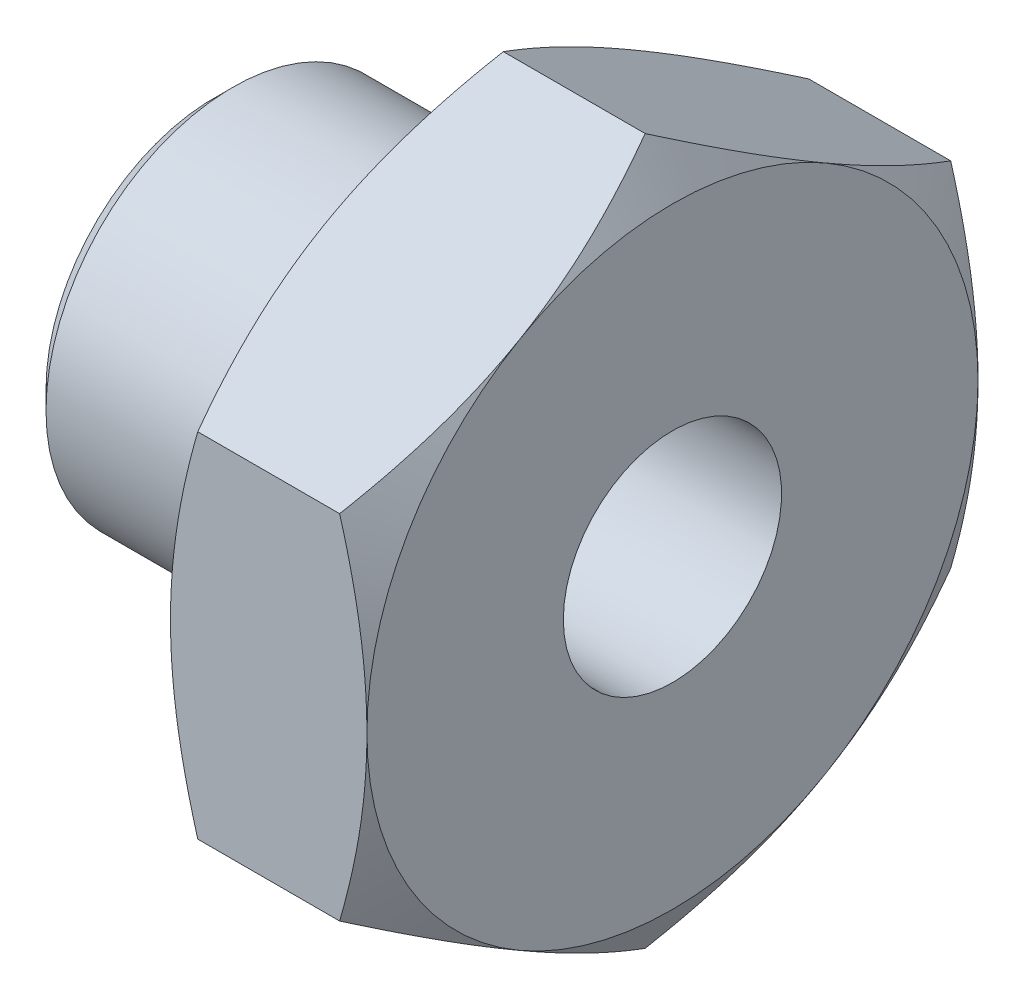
ISO-10303-21;
HEADER;
FILE_DESCRIPTION(('STEP AP214'),'2;1');
FILE_NAME('part.step','',(''),(''),'','','');
FILE_SCHEMA(('AUTOMOTIVE_DESIGN { 1 0 10303 214 1 1 1 1 }'));
ENDSEC;
DATA;
#1=APPLICATION_CONTEXT('core data for automotive mechanical design processes');
#2=APPLICATION_PROTOCOL_DEFINITION('international standard','automotive_design',2000,#1);
#3=PRODUCT_CONTEXT('',#1,'mechanical');
#4=PRODUCT('Part','Part','',(#3));
#5=PRODUCT_RELATED_PRODUCT_CATEGORY('part','',(#4));
#6=PRODUCT_DEFINITION_FORMATION('','',#4);
#7=PRODUCT_DEFINITION_CONTEXT('part definition',#1,'design');
#8=PRODUCT_DEFINITION('design','',#6,#7);
#9=PRODUCT_DEFINITION_SHAPE('','',#8);
#10=(LENGTH_UNIT() NAMED_UNIT(*) SI_UNIT(.MILLI.,.METRE.));
#11=(NAMED_UNIT(*) PLANE_ANGLE_UNIT() SI_UNIT($,.RADIAN.));
#12=(NAMED_UNIT(*) SI_UNIT($,.STERADIAN.) SOLID_ANGLE_UNIT());
#13=UNCERTAINTY_MEASURE_WITH_UNIT(LENGTH_MEASURE(1.E-05),#10,'distance_accuracy_value','');
#14=(GEOMETRIC_REPRESENTATION_CONTEXT(3) GLOBAL_UNCERTAINTY_ASSIGNED_CONTEXT((#13)) GLOBAL_UNIT_ASSIGNED_CONTEXT((#10,
#11,#12)) REPRESENTATION_CONTEXT('',''));
#15=CARTESIAN_POINT('',(0.,0.,0.));
#16=DIRECTION('',(0.,0.,1.));
#17=DIRECTION('',(1.,0.,0.));
#18=AXIS2_PLACEMENT_3D('',#15,#16,#17);
#19=CARTESIAN_POINT('',(-6.,0.,0.));
#20=DIRECTION('',(1.,0.,0.));
#21=DIRECTION('',(0.,0.,-1.));
#22=AXIS2_PLACEMENT_3D('',#19,#20,#21);
#23=PLANE('',#22);
#24=CARTESIAN_POINT('',(-6.,0.,0.));
#25=DIRECTION('',(-1.,0.,0.));
#26=DIRECTION('',(0.,0.,1.));
#27=AXIS2_PLACEMENT_3D('',#24,#25,#26);
#28=CIRCLE('',#27,3.852);
#29=CARTESIAN_POINT('',(-6.,0.,3.852));
#30=VERTEX_POINT('',#29);
#31=EDGE_CURVE('E144',#30,#30,#28,.T.);
#32=ORIENTED_EDGE('',*,*,#31,.T.);
#33=EDGE_LOOP('',(#32));
#34=FACE_BOUND('',#33,.T.);
#35=CARTESIAN_POINT('',(-6.,0.,0.));
#36=DIRECTION('',(-1.,0.,0.));
#37=DIRECTION('',(0.,0.,1.));
#38=AXIS2_PLACEMENT_3D('',#35,#36,#37);
#39=CIRCLE('',#38,2.5);
#40=CARTESIAN_POINT('',(-6.,0.,2.5));
#41=VERTEX_POINT('',#40);
#42=EDGE_CURVE('E519',#41,#41,#39,.T.);
#43=ORIENTED_EDGE('',*,*,#42,.F.);
#44=EDGE_LOOP('',(#43));
#45=FACE_BOUND('',#44,.T.);
#46=ADVANCED_FACE('F16',(#34,#45),#23,.F.);
#47=CARTESIAN_POINT('',(4.5,4.28,0.));
#48=DIRECTION('',(-1.,0.,0.));
#49=DIRECTION('',(0.,0.,1.));
#50=AXIS2_PLACEMENT_3D('',#47,#48,#49);
#51=PLANE('',#50);
#52=CARTESIAN_POINT('',(4.5,0.,0.));
#53=DIRECTION('',(-1.,0.,0.));
#54=DIRECTION('',(0.,0.,1.));
#55=AXIS2_PLACEMENT_3D('',#52,#53,#54);
#56=CIRCLE('',#55,7.);
#57=CARTESIAN_POINT('',(4.5,0.,7.));
#58=VERTEX_POINT('',#57);
#59=CARTESIAN_POINT('',(4.5,6.06217782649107,3.5));
#60=VERTEX_POINT('',#59);
#61=EDGE_CURVE('E266',#58,#60,#56,.T.);
#62=ORIENTED_EDGE('',*,*,#61,.F.);
#63=CARTESIAN_POINT('',(4.5,0.,0.));
#64=DIRECTION('',(-1.,0.,0.));
#65=DIRECTION('',(0.,0.,1.));
#66=AXIS2_PLACEMENT_3D('',#63,#64,#65);
#67=CIRCLE('',#66,7.);
#68=CARTESIAN_POINT('',(4.5,-6.06217782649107,3.5));
#69=VERTEX_POINT('',#68);
#70=EDGE_CURVE('E152',#69,#58,#67,.T.);
#71=ORIENTED_EDGE('',*,*,#70,.F.);
#72=CARTESIAN_POINT('',(4.5,-6.06217782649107,-3.5));
#73=VERTEX_POINT('',#72);
#74=EDGE_CURVE('E154',#73,#69,#67,.T.);
#75=ORIENTED_EDGE('',*,*,#74,.F.);
#76=CARTESIAN_POINT('',(4.5,0.,-7.));
#77=VERTEX_POINT('',#76);
#78=EDGE_CURVE('E160',#77,#73,#67,.T.);
#79=ORIENTED_EDGE('',*,*,#78,.F.);
#80=CARTESIAN_POINT('',(4.5,6.06217782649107,-3.5));
#81=VERTEX_POINT('',#80);
#82=EDGE_CURVE('E162',#81,#77,#67,.T.);
#83=ORIENTED_EDGE('',*,*,#82,.F.);
#84=EDGE_CURVE('E155',#60,#81,#67,.T.);
#85=ORIENTED_EDGE('',*,*,#84,.F.);
#86=EDGE_LOOP('',(#62,#71,#75,#79,#83,#85));
#87=FACE_BOUND('',#86,.T.);
#88=CARTESIAN_POINT('',(4.5,0.,0.));
#89=DIRECTION('',(-1.,0.,0.));
#90=DIRECTION('',(0.,0.,1.));
#91=AXIS2_PLACEMENT_3D('',#88,#89,#90);
#92=CIRCLE('',#91,2.5);
#93=CARTESIAN_POINT('',(4.5,0.,2.5));
#94=VERTEX_POINT('',#93);
#95=EDGE_CURVE('E335',#94,#94,#92,.T.);
#96=ORIENTED_EDGE('',*,*,#95,.T.);
#97=EDGE_LOOP('',(#96));
#98=FACE_BOUND('',#97,.T.);
#99=ADVANCED_FACE('F18',(#87,#98),#51,.F.);
#100=CARTESIAN_POINT('',(0.,-4.04145188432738,-7.));
#101=DIRECTION('',(1.,0.,0.));
#102=DIRECTION('',(0.,0.,-1.));
#103=AXIS2_PLACEMENT_3D('',#100,#101,#102);
#104=PLANE('',#103);
#105=CARTESIAN_POINT('',(0.,0.,0.));
#106=DIRECTION('',(1.,0.,0.));
#107=DIRECTION('',(0.,0.,-1.));
#108=AXIS2_PLACEMENT_3D('',#105,#106,#107);
#109=CIRCLE('',#108,4.28);
#110=CARTESIAN_POINT('',(0.,0.,-4.28));
#111=VERTEX_POINT('',#110);
#112=EDGE_CURVE('E150',#111,#111,#109,.T.);
#113=ORIENTED_EDGE('',*,*,#112,.T.);
#114=EDGE_LOOP('',(#113));
#115=FACE_BOUND('',#114,.T.);
#116=CARTESIAN_POINT('',(0.,0.,0.));
#117=DIRECTION('',(1.,0.,0.));
#118=DIRECTION('',(0.,0.,-1.));
#119=AXIS2_PLACEMENT_3D('',#116,#117,#118);
#120=CIRCLE('',#119,7.);
#121=CARTESIAN_POINT('',(0.,0.,-7.));
#122=VERTEX_POINT('',#121);
#123=CARTESIAN_POINT('',(0.,6.06217782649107,-3.5));
#124=VERTEX_POINT('',#123);
#125=EDGE_CURVE('E10',#122,#124,#120,.T.);
#126=ORIENTED_EDGE('',*,*,#125,.F.);
#127=CARTESIAN_POINT('',(0.,-6.06217782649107,-3.5));
#128=VERTEX_POINT('',#127);
#129=EDGE_CURVE('E20',#128,#122,#120,.T.);
#130=ORIENTED_EDGE('',*,*,#129,.F.);
#131=CARTESIAN_POINT('',(0.,-6.06217782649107,3.5));
#132=VERTEX_POINT('',#131);
#133=EDGE_CURVE('E167',#132,#128,#120,.T.);
#134=ORIENTED_EDGE('',*,*,#133,.F.);
#135=CARTESIAN_POINT('',(0.,0.,7.));
#136=VERTEX_POINT('',#135);
#137=EDGE_CURVE('E322',#136,#132,#120,.T.);
#138=ORIENTED_EDGE('',*,*,#137,.F.);
#139=CARTESIAN_POINT('',(0.,0.,0.));
#140=DIRECTION('',(-1.,0.,0.));
#141=DIRECTION('',(0.,0.,1.));
#142=AXIS2_PLACEMENT_3D('',#139,#140,#141);
#143=CIRCLE('',#142,7.);
#144=CARTESIAN_POINT('',(0.,6.06217782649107,3.5));
#145=VERTEX_POINT('',#144);
#146=EDGE_CURVE('E107',#136,#145,#143,.T.);
#147=ORIENTED_EDGE('',*,*,#146,.T.);
#148=EDGE_CURVE('E25',#124,#145,#120,.T.);
#149=ORIENTED_EDGE('',*,*,#148,.F.);
#150=EDGE_LOOP('',(#126,#130,#134,#138,#147,#149));
#151=FACE_BOUND('',#150,.T.);
#152=ADVANCED_FACE('F217',(#115,#151),#104,.F.);
#153=CARTESIAN_POINT('',(0.,0.,0.));
#154=DIRECTION('',(-1.,0.,0.));
#155=DIRECTION('',(0.,0.,1.));
#156=AXIS2_PLACEMENT_3D('',#153,#154,#155);
#157=CYLINDRICAL_SURFACE('',#156,4.28);
#158=CARTESIAN_POINT('',(-5.572,0.,0.));
#159=DIRECTION('',(-1.,0.,0.));
#160=DIRECTION('',(0.,0.,1.));
#161=AXIS2_PLACEMENT_3D('',#158,#159,#160);
#162=CIRCLE('',#161,4.28);
#163=CARTESIAN_POINT('',(-5.572,0.,4.28));
#164=VERTEX_POINT('',#163);
#165=EDGE_CURVE('E147',#164,#164,#162,.T.);
#166=ORIENTED_EDGE('',*,*,#165,.F.);
#167=EDGE_LOOP('',(#166));
#168=FACE_BOUND('',#167,.T.);
#169=ORIENTED_EDGE('',*,*,#112,.F.);
#170=EDGE_LOOP('',(#169));
#171=FACE_BOUND('',#170,.T.);
#172=ADVANCED_FACE('F310',(#168,#171),#157,.T.);
#173=CARTESIAN_POINT('',(-5.572,0.,0.));
#174=DIRECTION('',(1.,0.,0.));
#175=DIRECTION('',(0.,0.,-1.));
#176=AXIS2_PLACEMENT_3D('',#173,#174,#175);
#177=CONICAL_SURFACE('',#176,4.28,0.78539816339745);
#178=ORIENTED_EDGE('',*,*,#31,.F.);
#179=EDGE_LOOP('',(#178));
#180=FACE_BOUND('',#179,.T.);
#181=ORIENTED_EDGE('',*,*,#165,.T.);
#182=EDGE_LOOP('',(#181));
#183=FACE_BOUND('',#182,.T.);
#184=ADVANCED_FACE('F308',(#180,#183),#177,.T.);
#185=CARTESIAN_POINT('',(0.,0.,0.));
#186=DIRECTION('',(1.,0.,0.));
#187=DIRECTION('',(0.,0.,-1.));
#188=AXIS2_PLACEMENT_3D('',#185,#186,#187);
#189=CONICAL_SURFACE('',#188,7.,1.0471975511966);
#190=CARTESIAN_POINT('',(3.34968814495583,-10.7185284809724,-7.));
#191=CARTESIAN_POINT('',(3.20116463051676,-10.4111888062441,-7.));
#192=CARTESIAN_POINT('',(3.05411756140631,-10.1031224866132,-7.));
#193=CARTESIAN_POINT('',(2.76382000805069,-9.48514364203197,-7.));
#194=CARTESIAN_POINT('',(2.62057018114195,-9.17523080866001,-7.));
#195=CARTESIAN_POINT('',(2.33795615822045,-8.55149189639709,-7.));
#196=CARTESIAN_POINT('',(2.19861888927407,-8.2376535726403,-7.));
#197=CARTESIAN_POINT('',(1.92592921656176,-7.60739750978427,-7.));
#198=CARTESIAN_POINT('',(1.79257650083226,-7.29097990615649,-7.));
#199=CARTESIAN_POINT('',(1.53186418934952,-6.65113367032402,-7.));
#200=CARTESIAN_POINT('',(1.40459826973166,-6.32766665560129,-7.));
#201=CARTESIAN_POINT('',(1.16003377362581,-5.67691816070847,-7.));
#202=CARTESIAN_POINT('',(1.04273630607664,-5.34963626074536,-7.));
#203=CARTESIAN_POINT('',(0.821260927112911,-4.6914054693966,-7.));
#204=CARTESIAN_POINT('',(0.717055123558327,-4.36046606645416,-7.));
#205=CARTESIAN_POINT('',(0.525145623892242,-3.69389441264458,-7.));
#206=CARTESIAN_POINT('',(0.437436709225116,-3.35826368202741,-7.));
#207=CARTESIAN_POINT('',(0.282785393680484,-2.68202399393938,-7.));
#208=CARTESIAN_POINT('',(0.215848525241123,-2.34141373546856,-7.));
#209=CARTESIAN_POINT('',(0.134373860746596,-1.82750110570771,-7.));
#210=CARTESIAN_POINT('',(0.110368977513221,-1.65567627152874,-7.));
#211=CARTESIAN_POINT('',(0.0691417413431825,-1.31122101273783,-7.));
#212=CARTESIAN_POINT('',(0.0519187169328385,-1.13859066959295,-7.));
#213=CARTESIAN_POINT('',(0.0247186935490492,-0.793852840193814,-7.));
#214=CARTESIAN_POINT('',(0.014696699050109,-0.621748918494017,-7.));
#215=CARTESIAN_POINT('',(0.00195172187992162,-0.277271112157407,-7.));
#216=CARTESIAN_POINT('',(-0.00077135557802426,-0.104897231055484,-7.));
#217=CARTESIAN_POINT('',(0.0011463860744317,0.239761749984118,-7.));
#218=CARTESIAN_POINT('',(0.00578513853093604,0.412046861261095,-7.));
#219=CARTESIAN_POINT('',(0.02231118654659,0.756271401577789,-7.));
#220=CARTESIAN_POINT('',(0.0341988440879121,0.928210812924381,-7.));
#221=CARTESIAN_POINT('',(0.0715476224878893,1.34493894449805,-7.));
#222=CARTESIAN_POINT('',(0.100640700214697,1.58940748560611,-7.));
#223=CARTESIAN_POINT('',(0.171866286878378,2.07647122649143,-7.));
#224=CARTESIAN_POINT('',(0.214002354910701,2.31906589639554,-7.));
#225=CARTESIAN_POINT('',(0.309819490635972,2.80218175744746,-7.));
#226=CARTESIAN_POINT('',(0.363511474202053,3.04270076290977,-7.));
#227=CARTESIAN_POINT('',(0.480802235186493,3.52126417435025,-7.));
#228=CARTESIAN_POINT('',(0.544400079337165,3.75930881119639,-7.));
#229=CARTESIAN_POINT('',(0.681643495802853,4.23878647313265,-7.));
#230=CARTESIAN_POINT('',(0.755497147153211,4.48015952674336,-7.));
#231=CARTESIAN_POINT('',(0.910501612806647,4.96035431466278,-7.));
#232=CARTESIAN_POINT('',(0.991647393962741,5.19917768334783,-7.));
#233=CARTESIAN_POINT('',(1.15955997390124,5.67331479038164,-7.));
#234=CARTESIAN_POINT('',(1.2462925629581,5.90864071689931,-7.));
#235=CARTESIAN_POINT('',(1.42484844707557,6.37746676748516,-7.));
#236=CARTESIAN_POINT('',(1.51667379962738,6.61096610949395,-7.));
#237=CARTESIAN_POINT('',(1.61054174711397,6.84361717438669,-7.));
#238=B_SPLINE_CURVE_WITH_KNOTS('',3,(#190,#191,#192,#193,#194,#195,#196,#197,#198,#199,#200,
#201,#202,#203,#204,#205,#206,#207,#208,#209,#210,#211,#212,#213,#214,#215,#216,#217,#218,#219,
#220,#221,#222,#223,#224,#225,#226,#227,#228,#229,#230,#231,#232,#233,#234,#235,#236,#237),
.UNSPECIFIED.,.F.,.F.,(4,2,2,2,2,2,2,2,2,2,2,2,2,2,2,2,2,2,2,2,2,2,2,4),(0.,1.02405093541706,
2.04827800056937,3.07836630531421,4.10840085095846,5.15108102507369,6.19387704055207,
7.23441225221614,8.27461774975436,9.31510005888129,9.83546782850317,10.3557840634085,
10.8728201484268,11.3898495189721,11.906733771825,12.4236438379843,13.1618132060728,
13.900184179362,14.6392557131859,15.3782576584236,16.1353741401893,16.8919720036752,
17.6443112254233,18.3969566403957),.UNSPECIFIED.);
#239=CARTESIAN_POINT('',(0.62521478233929,-4.04145188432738,-7.));
#240=VERTEX_POINT('',#239);
#241=EDGE_CURVE('E123',#122,#240,#238,.F.);
#242=ORIENTED_EDGE('',*,*,#241,.T.);
#243=CARTESIAN_POINT('',(0.625281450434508,-4.04133641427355,-7.0002));
#244=CARTESIAN_POINT('',(0.573999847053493,-4.13017208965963,-6.84633209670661));
#245=CARTESIAN_POINT('',(0.525045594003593,-4.21933898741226,-6.69189049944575));
#246=CARTESIAN_POINT('',(0.43243278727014,-4.3983969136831,-6.38175307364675));
#247=CARTESIAN_POINT('',(0.388776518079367,-4.48828823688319,-6.22605673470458));
#248=CARTESIAN_POINT('',(0.266611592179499,-4.7594014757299,-5.75647483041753));
#249=CARTESIAN_POINT('',(0.197125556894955,-4.94169356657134,-5.4407356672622));
#250=CARTESIAN_POINT('',(0.115644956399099,-5.21449036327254,-4.96823775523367));
#251=CARTESIAN_POINT('',(0.092433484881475,-5.30417998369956,-4.81289077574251));
#252=CARTESIAN_POINT('',(0.0535112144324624,-5.48396448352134,-4.50149488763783));
#253=CARTESIAN_POINT('',(0.0377997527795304,-5.57405932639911,-4.34544604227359));
#254=CARTESIAN_POINT('',(0.0142779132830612,-5.75440548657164,-4.03307732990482));
#255=CARTESIAN_POINT('',(0.00645856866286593,-5.84465650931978,-3.87675797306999));
#256=CARTESIAN_POINT('',(-0.00111975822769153,-6.02523694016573,-3.56398349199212));
#257=CARTESIAN_POINT('',(-0.000878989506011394,-6.11556634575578,-3.40752837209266));
#258=CARTESIAN_POINT('',(0.0108597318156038,-6.36303901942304,-2.97889312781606));
#259=CARTESIAN_POINT('',(0.0305657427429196,-6.52010127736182,-2.7068533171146));
#260=CARTESIAN_POINT('',(0.0930534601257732,-6.83318259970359,-2.1645805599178));
#261=CARTESIAN_POINT('',(0.135856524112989,-6.98920056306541,-1.89434952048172));
#262=CARTESIAN_POINT('',(0.242851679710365,-7.30291195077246,-1.35098545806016));
#263=CARTESIAN_POINT('',(0.307497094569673,-7.46056579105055,-1.07792099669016));
#264=CARTESIAN_POINT('',(0.454216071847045,-7.77352241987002,-0.535864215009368));
#265=CARTESIAN_POINT('',(0.53625517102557,-7.92882921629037,-0.266864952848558));
#266=CARTESIAN_POINT('',(0.625281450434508,-8.0830192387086,0.000200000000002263));
#267=B_SPLINE_CURVE_WITH_KNOTS('',3,(#243,#244,#245,#246,#247,#248,#249,#250,#251,#252,#253,
#254,#255,#256,#257,#258,#259,#260,#261,#262,#263,#264,#265,#266),.UNSPECIFIED.,.F.,.F.,(4,2,2,
2,2,2,2,2,2,2,2,4),(0.,0.554727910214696,1.10969417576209,2.2219327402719,2.76443041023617,
3.30688013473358,3.8487128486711,4.3905288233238,5.33376515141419,6.27787517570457,
7.2429241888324,8.20607866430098),.UNSPECIFIED.);
#268=EDGE_CURVE('E112',#240,#128,#267,.T.);
#269=ORIENTED_EDGE('',*,*,#268,.T.);
#270=ORIENTED_EDGE('',*,*,#129,.T.);
#271=EDGE_LOOP('',(#242,#269,#270));
#272=FACE_BOUND('',#271,.T.);
#273=ADVANCED_FACE('F288',(#272),#189,.T.);
#274=CARTESIAN_POINT('',(0.62521478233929,-8.08290376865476,0.));
#275=VERTEX_POINT('',#274);
#276=EDGE_CURVE('E291',#128,#275,#267,.T.);
#277=ORIENTED_EDGE('',*,*,#276,.T.);
#278=CARTESIAN_POINT('',(0.625281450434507,-8.0830192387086,-0.00019999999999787));
#279=CARTESIAN_POINT('',(0.573999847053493,-7.99418356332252,0.153667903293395));
#280=CARTESIAN_POINT('',(0.525045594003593,-7.90501666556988,0.308109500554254));
#281=CARTESIAN_POINT('',(0.43243278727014,-7.72595873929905,0.618246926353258));
#282=CARTESIAN_POINT('',(0.388776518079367,-7.63606741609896,0.773943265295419));
#283=CARTESIAN_POINT('',(0.266611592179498,-7.36495417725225,1.24352516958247));
#284=CARTESIAN_POINT('',(0.197125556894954,-7.18266208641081,1.55926433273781));
#285=CARTESIAN_POINT('',(0.115644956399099,-6.9098652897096,2.03176224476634));
#286=CARTESIAN_POINT('',(0.0924334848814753,-6.82017566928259,2.18710922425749));
#287=CARTESIAN_POINT('',(0.0535112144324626,-6.64039116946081,2.49850511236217));
#288=CARTESIAN_POINT('',(0.03779975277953,-6.55029632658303,2.65455395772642));
#289=CARTESIAN_POINT('',(0.0142779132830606,-6.36995016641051,2.96692267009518));
#290=CARTESIAN_POINT('',(0.00645856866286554,-6.27969914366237,3.12324202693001));
#291=CARTESIAN_POINT('',(-0.00111975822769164,-6.09911871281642,3.43601650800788));
#292=CARTESIAN_POINT('',(-0.000878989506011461,-6.00878930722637,3.59247162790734));
#293=CARTESIAN_POINT('',(0.0108597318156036,-5.76131663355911,4.02110687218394));
#294=CARTESIAN_POINT('',(0.030565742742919,-5.60425437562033,4.2931466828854));
#295=CARTESIAN_POINT('',(0.0930534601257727,-5.29117305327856,4.8354194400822));
#296=CARTESIAN_POINT('',(0.135856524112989,-5.13515508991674,5.10565047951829));
#297=CARTESIAN_POINT('',(0.242851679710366,-4.82144370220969,5.64901454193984));
#298=CARTESIAN_POINT('',(0.307497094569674,-4.66378986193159,5.92207900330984));
#299=CARTESIAN_POINT('',(0.454216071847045,-4.35083323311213,6.46413578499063));
#300=CARTESIAN_POINT('',(0.536255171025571,-4.19552643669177,6.73313504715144));
#301=CARTESIAN_POINT('',(0.625281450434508,-4.04133641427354,7.0002));
#302=B_SPLINE_CURVE_WITH_KNOTS('',3,(#278,#279,#280,#281,#282,#283,#284,#285,#286,#287,#288,
#289,#290,#291,#292,#293,#294,#295,#296,#297,#298,#299,#300,#301),.UNSPECIFIED.,.F.,.F.,(4,2,2,
2,2,2,2,2,2,2,2,4),(0.,0.554727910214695,1.10969417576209,2.2219327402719,2.76443041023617,
3.30688013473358,3.8487128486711,4.39052882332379,5.33376515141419,6.27787517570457,
7.24292418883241,8.20607866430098),.UNSPECIFIED.);
#303=EDGE_CURVE('E329',#275,#132,#302,.T.);
#304=ORIENTED_EDGE('',*,*,#303,.T.);
#305=ORIENTED_EDGE('',*,*,#133,.T.);
#306=EDGE_LOOP('',(#277,#304,#305));
#307=FACE_BOUND('',#306,.T.);
#308=ADVANCED_FACE('F327',(#307),#189,.T.);
#309=CARTESIAN_POINT('',(3.34968693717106,-10.718525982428,7.));
#310=CARTESIAN_POINT('',(3.20116347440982,-10.4111863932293,7.));
#311=CARTESIAN_POINT('',(3.05411645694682,-10.1031201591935,7.));
#312=CARTESIAN_POINT('',(2.76381900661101,-9.48514148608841,7.));
#313=CARTESIAN_POINT('',(2.62056923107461,-9.1752287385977,7.));
#314=CARTESIAN_POINT('',(2.33795531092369,-8.55148999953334,7.));
#315=CARTESIAN_POINT('',(2.19861809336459,-8.23765176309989,7.));
#316=CARTESIAN_POINT('',(1.92592852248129,-7.60739587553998,7.));
#317=CARTESIAN_POINT('',(1.79257585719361,-7.29097835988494,7.));
#318=CARTESIAN_POINT('',(1.53186364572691,-6.65113230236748,7.));
#319=CARTESIAN_POINT('',(1.40459777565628,-6.32766537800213,7.));
#320=CARTESIAN_POINT('',(1.16003337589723,-5.67691706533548,7.));
#321=CARTESIAN_POINT('',(1.04273595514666,-5.34963525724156,7.));
#322=CARTESIAN_POINT('',(0.821260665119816,-4.6914046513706,7.));
#323=CARTESIAN_POINT('',(0.717054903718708,-4.36046534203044,7.));
#324=CARTESIAN_POINT('',(0.525145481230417,-3.69389387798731,7.));
#325=CARTESIAN_POINT('',(0.437436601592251,-3.35826324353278,7.));
#326=CARTESIAN_POINT('',(0.282785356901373,-2.68202380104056,7.));
#327=CARTESIAN_POINT('',(0.215848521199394,-2.34141369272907,7.));
#328=CARTESIAN_POINT('',(0.134373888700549,-1.82750129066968,7.));
#329=CARTESIAN_POINT('',(0.110369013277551,-1.65567653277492,7.));
#330=CARTESIAN_POINT('',(0.0691417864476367,-1.31122142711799,7.));
#331=CARTESIAN_POINT('',(0.0519187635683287,-1.13859116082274,7.));
#332=CARTESIAN_POINT('',(0.0247187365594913,-0.793853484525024,7.));
#333=CARTESIAN_POINT('',(0.0146967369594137,-0.621749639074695,7.));
#334=CARTESIAN_POINT('',(0.00195174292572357,-0.277271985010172,7.));
#335=CARTESIAN_POINT('',(-0.000771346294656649,-0.104898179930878,7.));
#336=CARTESIAN_POINT('',(0.00114636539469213,0.239760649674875,7.));
#337=CARTESIAN_POINT('',(0.00578509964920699,0.412045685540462,7.));
#338=CARTESIAN_POINT('',(0.022311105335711,0.756270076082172,7.));
#339=CARTESIAN_POINT('',(0.0341987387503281,0.928209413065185,7.));
#340=CARTESIAN_POINT('',(0.0715474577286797,1.34493742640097,7.));
#341=CARTESIAN_POINT('',(0.100640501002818,1.58940592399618,7.));
#342=CARTESIAN_POINT('',(0.171866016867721,2.07646957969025,7.));
#343=CARTESIAN_POINT('',(0.21400204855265,2.31906420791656,7.));
#344=CARTESIAN_POINT('',(0.309819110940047,2.80217998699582,7.));
#345=CARTESIAN_POINT('',(0.36351105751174,3.04269895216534,7.));
#346=CARTESIAN_POINT('',(0.480801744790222,3.5212622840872,7.));
#347=CARTESIAN_POINT('',(0.544399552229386,3.75930688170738,7.));
#348=CARTESIAN_POINT('',(0.681642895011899,4.23878446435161,7.));
#349=CARTESIAN_POINT('',(0.755496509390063,4.4801574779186,7.));
#350=CARTESIAN_POINT('',(0.910500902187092,4.9603521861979,7.));
#351=CARTESIAN_POINT('',(0.991646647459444,5.19917551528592,7.));
#352=CARTESIAN_POINT('',(1.15955915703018,5.67331254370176,7.));
#353=CARTESIAN_POINT('',(1.24629171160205,5.90863843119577,7.));
#354=CARTESIAN_POINT('',(1.42484752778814,6.37746440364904,7.));
#355=CARTESIAN_POINT('',(1.51667284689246,6.61096370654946,7.));
#356=CARTESIAN_POINT('',(1.61054076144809,6.84361473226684,7.));
#357=B_SPLINE_CURVE_WITH_KNOTS('',3,(#309,#310,#311,#312,#313,#314,#315,#316,#317,#318,#319,
#320,#321,#322,#323,#324,#325,#326,#327,#328,#329,#330,#331,#332,#333,#334,#335,#336,#337,#338,
#339,#340,#341,#342,#343,#344,#345,#346,#347,#348,#349,#350,#351,#352,#353,#354,#355,#356),
.UNSPECIFIED.,.F.,.F.,(4,2,2,2,2,2,2,2,2,2,2,2,2,2,2,2,2,2,2,2,2,2,2,4),(0.,1.02405063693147,
2.04827740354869,3.07836540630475,4.1083996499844,5.15107951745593,6.19387522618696,
7.23441013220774,8.27461532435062,9.31509717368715,9.83546471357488,10.35578071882,
10.8728165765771,11.3898457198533,11.9067297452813,12.4236395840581,13.1618088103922,
13.9001796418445,14.6392510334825,15.3782528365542,16.1353691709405,16.8919668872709,
17.6443059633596,18.3969512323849),.UNSPECIFIED.);
#358=CARTESIAN_POINT('',(0.62521478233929,-4.04145188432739,7.));
#359=VERTEX_POINT('',#358);
#360=EDGE_CURVE('E114',#359,#136,#357,.T.);
#361=ORIENTED_EDGE('',*,*,#360,.T.);
#362=ORIENTED_EDGE('',*,*,#137,.T.);
#363=EDGE_CURVE('E332',#132,#359,#302,.T.);
#364=ORIENTED_EDGE('',*,*,#363,.T.);
#365=EDGE_LOOP('',(#361,#362,#364));
#366=FACE_BOUND('',#365,.T.);
#367=ADVANCED_FACE('F418',(#366),#189,.T.);
#368=CARTESIAN_POINT('',(0.625281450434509,4.04133641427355,7.0002));
#369=CARTESIAN_POINT('',(0.573999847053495,4.13017208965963,6.84633209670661));
#370=CARTESIAN_POINT('',(0.525045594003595,4.21933898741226,6.69189049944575));
#371=CARTESIAN_POINT('',(0.432432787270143,4.3983969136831,6.38175307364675));
#372=CARTESIAN_POINT('',(0.388776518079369,4.48828823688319,6.22605673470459));
#373=CARTESIAN_POINT('',(0.266611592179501,4.7594014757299,5.75647483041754));
#374=CARTESIAN_POINT('',(0.197125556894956,4.94169356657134,5.4407356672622));
#375=CARTESIAN_POINT('',(0.1156449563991,5.21449036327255,4.96823775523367));
#376=CARTESIAN_POINT('',(0.0924334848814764,5.30417998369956,4.81289077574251));
#377=CARTESIAN_POINT('',(0.053511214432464,5.48396448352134,4.50149488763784));
#378=CARTESIAN_POINT('',(0.0377997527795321,5.57405932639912,4.34544604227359));
#379=CARTESIAN_POINT('',(0.014277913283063,5.75440548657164,4.03307732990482));
#380=CARTESIAN_POINT('',(0.00645856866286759,5.84465650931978,3.87675797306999));
#381=CARTESIAN_POINT('',(-0.00111975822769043,6.02523694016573,3.56398349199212));
#382=CARTESIAN_POINT('',(-0.000878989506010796,6.11556634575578,3.40752837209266));
#383=CARTESIAN_POINT('',(0.0108597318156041,6.36303901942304,2.97889312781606));
#384=CARTESIAN_POINT('',(0.030565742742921,6.52010127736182,2.7068533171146));
#385=CARTESIAN_POINT('',(0.0930534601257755,6.83318259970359,2.1645805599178));
#386=CARTESIAN_POINT('',(0.135856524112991,6.98920056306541,1.89434952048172));
#387=CARTESIAN_POINT('',(0.242851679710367,7.30291195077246,1.35098545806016));
#388=CARTESIAN_POINT('',(0.307497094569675,7.46056579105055,1.07792099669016));
#389=CARTESIAN_POINT('',(0.454216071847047,7.77352241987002,0.53586421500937));
#390=CARTESIAN_POINT('',(0.536255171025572,7.92882921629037,0.266864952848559));
#391=CARTESIAN_POINT('',(0.625281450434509,8.08301923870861,-0.000200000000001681));
#392=B_SPLINE_CURVE_WITH_KNOTS('',3,(#368,#369,#370,#371,#372,#373,#374,#375,#376,#377,#378,
#379,#380,#381,#382,#383,#384,#385,#386,#387,#388,#389,#390,#391),.UNSPECIFIED.,.F.,.F.,(4,2,2,
2,2,2,2,2,2,2,2,4),(0.,0.554727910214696,1.10969417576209,2.2219327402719,2.76443041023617,
3.30688013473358,3.8487128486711,4.3905288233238,5.33376515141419,6.27787517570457,
7.24292418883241,8.20607866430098),.UNSPECIFIED.);
#393=CARTESIAN_POINT('',(0.62521478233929,4.04145188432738,7.));
#394=VERTEX_POINT('',#393);
#395=EDGE_CURVE('E39',#394,#145,#392,.T.);
#396=ORIENTED_EDGE('',*,*,#395,.T.);
#397=ORIENTED_EDGE('',*,*,#146,.F.);
#398=EDGE_CURVE('E104',#136,#394,#357,.T.);
#399=ORIENTED_EDGE('',*,*,#398,.T.);
#400=EDGE_LOOP('',(#396,#397,#399));
#401=FACE_BOUND('',#400,.T.);
#402=ADVANCED_FACE('F105',(#401),#189,.T.);
#403=CARTESIAN_POINT('',(0.625281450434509,8.08301923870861,0.000199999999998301));
#404=CARTESIAN_POINT('',(0.573999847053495,7.99418356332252,-0.153667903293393));
#405=CARTESIAN_POINT('',(0.525045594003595,7.90501666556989,-0.308109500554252));
#406=CARTESIAN_POINT('',(0.432432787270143,7.72595873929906,-0.618246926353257));
#407=CARTESIAN_POINT('',(0.388776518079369,7.63606741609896,-0.773943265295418));
#408=CARTESIAN_POINT('',(0.2666115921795,7.36495417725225,-1.24352516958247));
#409=CARTESIAN_POINT('',(0.197125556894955,7.18266208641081,-1.5592643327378));
#410=CARTESIAN_POINT('',(0.1156449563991,6.90986528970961,-2.03176224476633));
#411=CARTESIAN_POINT('',(0.0924334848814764,6.82017566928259,-2.18710922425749));
#412=CARTESIAN_POINT('',(0.0535112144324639,6.64039116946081,-2.49850511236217));
#413=CARTESIAN_POINT('',(0.0377997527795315,6.55029632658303,-2.65455395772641));
#414=CARTESIAN_POINT('',(0.0142779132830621,6.36995016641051,-2.96692267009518));
#415=CARTESIAN_POINT('',(0.00645856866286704,6.27969914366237,-3.12324202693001));
#416=CARTESIAN_POINT('',(-0.00111975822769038,6.09911871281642,-3.43601650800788));
#417=CARTESIAN_POINT('',(-0.000878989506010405,6.00878930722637,-3.59247162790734));
#418=CARTESIAN_POINT('',(0.0108597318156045,5.76131663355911,-4.02110687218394));
#419=CARTESIAN_POINT('',(0.0305657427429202,5.60425437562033,-4.2931466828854));
#420=CARTESIAN_POINT('',(0.093053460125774,5.29117305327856,-4.8354194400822));
#421=CARTESIAN_POINT('',(0.13585652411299,5.13515508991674,-5.10565047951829));
#422=CARTESIAN_POINT('',(0.242851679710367,4.82144370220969,-5.64901454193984));
#423=CARTESIAN_POINT('',(0.307497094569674,4.6637898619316,-5.92207900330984));
#424=CARTESIAN_POINT('',(0.454216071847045,4.35083323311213,-6.46413578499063));
#425=CARTESIAN_POINT('',(0.53625517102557,4.19552643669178,-6.73313504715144));
#426=CARTESIAN_POINT('',(0.625281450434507,4.04133641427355,-7.0002));
#427=B_SPLINE_CURVE_WITH_KNOTS('',3,(#403,#404,#405,#406,#407,#408,#409,#410,#411,#412,#413,
#414,#415,#416,#417,#418,#419,#420,#421,#422,#423,#424,#425,#426),.UNSPECIFIED.,.F.,.F.,(4,2,2,
2,2,2,2,2,2,2,2,4),(0.,0.554727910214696,1.10969417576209,2.2219327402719,2.76443041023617,
3.30688013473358,3.84871284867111,4.3905288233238,5.33376515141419,6.27787517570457,
7.2429241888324,8.20607866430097),.UNSPECIFIED.);
#428=CARTESIAN_POINT('',(0.62521478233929,8.08290376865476,0.));
#429=VERTEX_POINT('',#428);
#430=EDGE_CURVE('E32',#429,#124,#427,.T.);
#431=ORIENTED_EDGE('',*,*,#430,.T.);
#432=ORIENTED_EDGE('',*,*,#148,.T.);
#433=EDGE_CURVE('E122',#145,#429,#392,.T.);
#434=ORIENTED_EDGE('',*,*,#433,.T.);
#435=EDGE_LOOP('',(#431,#432,#434));
#436=FACE_BOUND('',#435,.T.);
#437=ADVANCED_FACE('F214',(#436),#189,.T.);
#438=CARTESIAN_POINT('',(0.62521478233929,4.04145188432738,-7.));
#439=VERTEX_POINT('',#438);
#440=EDGE_CURVE('E258',#124,#439,#427,.T.);
#441=ORIENTED_EDGE('',*,*,#440,.T.);
#442=EDGE_CURVE('E281',#439,#122,#238,.F.);
#443=ORIENTED_EDGE('',*,*,#442,.T.);
#444=ORIENTED_EDGE('',*,*,#125,.T.);
#445=EDGE_LOOP('',(#441,#443,#444));
#446=FACE_BOUND('',#445,.T.);
#447=ADVANCED_FACE('F280',(#446),#189,.T.);
#448=CARTESIAN_POINT('',(3.87478521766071,0.,0.));
#449=DIRECTION('',(-1.,0.,0.));
#450=DIRECTION('',(0.,0.,1.));
#451=AXIS2_PLACEMENT_3D('',#448,#449,#450);
#452=CONICAL_SURFACE('',#451,8.08290376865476,1.0471975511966);
#453=CARTESIAN_POINT('',(3.8747185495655,-8.0830192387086,0.000200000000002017));
#454=CARTESIAN_POINT('',(3.92600015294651,-7.99418356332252,-0.153667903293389));
#455=CARTESIAN_POINT('',(3.97495440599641,-7.90501666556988,-0.308109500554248));
#456=CARTESIAN_POINT('',(4.06756721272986,-7.72595873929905,-0.618246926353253));
#457=CARTESIAN_POINT('',(4.11122348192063,-7.63606741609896,-0.773943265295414));
#458=CARTESIAN_POINT('',(4.2333884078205,-7.36495417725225,-1.24352516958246));
#459=CARTESIAN_POINT('',(4.30287444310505,-7.18266208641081,-1.5592643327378));
#460=CARTESIAN_POINT('',(4.3843550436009,-6.90986528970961,-2.03176224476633));
#461=CARTESIAN_POINT('',(4.40756651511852,-6.82017566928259,-2.18710922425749));
#462=CARTESIAN_POINT('',(4.44648878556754,-6.64039116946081,-2.49850511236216));
#463=CARTESIAN_POINT('',(4.46220024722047,-6.55029632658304,-2.65455395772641));
#464=CARTESIAN_POINT('',(4.48572208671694,-6.36995016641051,-2.96692267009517));
#465=CARTESIAN_POINT('',(4.49354143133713,-6.27969914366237,-3.12324202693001));
#466=CARTESIAN_POINT('',(4.50111975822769,-6.09911871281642,-3.43601650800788));
#467=CARTESIAN_POINT('',(4.50087898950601,-6.00878930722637,-3.59247162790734));
#468=CARTESIAN_POINT('',(4.4891402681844,-5.76131663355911,-4.02110687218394));
#469=CARTESIAN_POINT('',(4.46943425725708,-5.60425437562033,-4.2931466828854));
#470=CARTESIAN_POINT('',(4.40694653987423,-5.29117305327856,-4.8354194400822));
#471=CARTESIAN_POINT('',(4.36414347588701,-5.13515508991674,-5.10565047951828));
#472=CARTESIAN_POINT('',(4.25714832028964,-4.82144370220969,-5.64901454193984));
#473=CARTESIAN_POINT('',(4.19250290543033,-4.6637898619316,-5.92207900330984));
#474=CARTESIAN_POINT('',(4.04578392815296,-4.35083323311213,-6.46413578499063));
#475=CARTESIAN_POINT('',(3.96374482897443,-4.19552643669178,-6.73313504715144));
#476=CARTESIAN_POINT('',(3.8747185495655,-4.04133641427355,-7.0002));
#477=B_SPLINE_CURVE_WITH_KNOTS('',3,(#453,#454,#455,#456,#457,#458,#459,#460,#461,#462,#463,
#464,#465,#466,#467,#468,#469,#470,#471,#472,#473,#474,#475,#476),.UNSPECIFIED.,.F.,.F.,(4,2,2,
2,2,2,2,2,2,2,2,4),(0.,0.554727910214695,1.10969417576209,2.2219327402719,2.76443041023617,
3.30688013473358,3.8487128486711,4.39052882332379,5.33376515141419,6.27787517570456,
7.2429241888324,8.20607866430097),.UNSPECIFIED.);
#478=CARTESIAN_POINT('',(3.87478521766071,-4.04145188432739,-7.));
#479=VERTEX_POINT('',#478);
#480=EDGE_CURVE('E176',#73,#479,#477,.T.);
#481=ORIENTED_EDGE('',*,*,#480,.T.);
#482=CARTESIAN_POINT('',(1.15031185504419,-10.7185284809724,-7.));
#483=CARTESIAN_POINT('',(1.29883536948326,-10.4111888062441,-7.));
#484=CARTESIAN_POINT('',(1.44588243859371,-10.1031224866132,-7.));
#485=CARTESIAN_POINT('',(1.73617999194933,-9.48514364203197,-7.));
#486=CARTESIAN_POINT('',(1.87942981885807,-9.17523080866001,-7.));
#487=CARTESIAN_POINT('',(2.16204384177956,-8.55149189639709,-7.));
#488=CARTESIAN_POINT('',(2.30138111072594,-8.2376535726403,-7.));
#489=CARTESIAN_POINT('',(2.57407078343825,-7.60739750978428,-7.));
#490=CARTESIAN_POINT('',(2.70742349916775,-7.2909799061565,-7.));
#491=CARTESIAN_POINT('',(2.96813581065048,-6.65113367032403,-7.));
#492=CARTESIAN_POINT('',(3.09540173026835,-6.32766665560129,-7.));
#493=CARTESIAN_POINT('',(3.3399662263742,-5.67691816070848,-7.));
#494=CARTESIAN_POINT('',(3.45726369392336,-5.34963626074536,-7.));
#495=CARTESIAN_POINT('',(3.67873907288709,-4.6914054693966,-7.));
#496=CARTESIAN_POINT('',(3.78294487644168,-4.36046606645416,-7.));
#497=CARTESIAN_POINT('',(3.97485437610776,-3.69389441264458,-7.));
#498=CARTESIAN_POINT('',(4.06256329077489,-3.35826368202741,-7.));
#499=CARTESIAN_POINT('',(4.21721460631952,-2.68202399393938,-7.));
#500=CARTESIAN_POINT('',(4.28415147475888,-2.34141373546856,-7.));
#501=CARTESIAN_POINT('',(4.36562613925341,-1.82750110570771,-7.));
#502=CARTESIAN_POINT('',(4.38963102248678,-1.65567627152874,-7.));
#503=CARTESIAN_POINT('',(4.43085825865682,-1.31122101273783,-7.));
#504=CARTESIAN_POINT('',(4.44808128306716,-1.13859066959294,-7.));
#505=CARTESIAN_POINT('',(4.47528130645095,-0.793852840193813,-7.));
#506=CARTESIAN_POINT('',(4.48530330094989,-0.621748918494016,-7.));
#507=CARTESIAN_POINT('',(4.49804827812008,-0.277271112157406,-7.));
#508=CARTESIAN_POINT('',(4.50077135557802,-0.104897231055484,-7.));
#509=CARTESIAN_POINT('',(4.49885361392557,0.239761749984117,-7.));
#510=CARTESIAN_POINT('',(4.49421486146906,0.412046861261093,-7.));
#511=CARTESIAN_POINT('',(4.47768881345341,0.756271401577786,-7.));
#512=CARTESIAN_POINT('',(4.46580115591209,0.928210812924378,-7.));
#513=CARTESIAN_POINT('',(4.42845237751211,1.34493894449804,-7.));
#514=CARTESIAN_POINT('',(4.3993592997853,1.5894074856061,-7.));
#515=CARTESIAN_POINT('',(4.32813371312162,2.07647122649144,-7.));
#516=CARTESIAN_POINT('',(4.2859976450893,2.31906589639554,-7.));
#517=CARTESIAN_POINT('',(4.19018050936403,2.80218175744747,-7.));
#518=CARTESIAN_POINT('',(4.13648852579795,3.04270076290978,-7.));
#519=CARTESIAN_POINT('',(4.01919776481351,3.52126417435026,-7.));
#520=CARTESIAN_POINT('',(3.95559992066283,3.7593088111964,-7.));
#521=CARTESIAN_POINT('',(3.81835650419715,4.23878647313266,-7.));
#522=CARTESIAN_POINT('',(3.74450285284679,4.48015952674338,-7.));
#523=CARTESIAN_POINT('',(3.58949838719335,4.9603543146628,-7.));
#524=CARTESIAN_POINT('',(3.50835260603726,5.19917768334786,-7.));
#525=CARTESIAN_POINT('',(3.34044002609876,5.67331479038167,-7.));
#526=CARTESIAN_POINT('',(3.2537074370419,5.90864071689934,-7.));
#527=CARTESIAN_POINT('',(3.07515155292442,6.3774667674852,-7.));
#528=CARTESIAN_POINT('',(2.98332620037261,6.61096610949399,-7.));
#529=CARTESIAN_POINT('',(2.88945825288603,6.84361717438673,-7.));
#530=B_SPLINE_CURVE_WITH_KNOTS('',3,(#482,#483,#484,#485,#486,#487,#488,#489,#490,#491,#492,
#493,#494,#495,#496,#497,#498,#499,#500,#501,#502,#503,#504,#505,#506,#507,#508,#509,#510,#511,
#512,#513,#514,#515,#516,#517,#518,#519,#520,#521,#522,#523,#524,#525,#526,#527,#528,#529),
.UNSPECIFIED.,.F.,.F.,(4,2,2,2,2,2,2,2,2,2,2,2,2,2,2,2,2,2,2,2,2,2,2,4),(0.,1.02405093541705,
2.04827800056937,3.0783663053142,4.10840085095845,5.15108102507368,6.19387704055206,
7.23441225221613,8.27461774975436,9.31510005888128,9.83546782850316,10.3557840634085,
10.8728201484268,11.3898495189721,11.906733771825,12.4236438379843,13.1618132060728,
13.900184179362,14.6392557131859,15.3782576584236,16.1353741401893,16.8919720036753,
17.6443112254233,18.3969566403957),.UNSPECIFIED.);
#531=EDGE_CURVE('E178',#479,#77,#530,.T.);
#532=ORIENTED_EDGE('',*,*,#531,.T.);
#533=ORIENTED_EDGE('',*,*,#78,.T.);
#534=EDGE_LOOP('',(#481,#532,#533));
#535=FACE_BOUND('',#534,.T.);
#536=ADVANCED_FACE('F174',(#535),#452,.T.);
#537=CARTESIAN_POINT('',(3.87478521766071,4.04145188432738,-7.));
#538=VERTEX_POINT('',#537);
#539=EDGE_CURVE('E193',#77,#538,#530,.T.);
#540=ORIENTED_EDGE('',*,*,#539,.T.);
#541=CARTESIAN_POINT('',(3.8747185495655,4.04133641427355,-7.0002));
#542=CARTESIAN_POINT('',(3.92600015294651,4.13017208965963,-6.84633209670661));
#543=CARTESIAN_POINT('',(3.97495440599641,4.21933898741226,-6.69189049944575));
#544=CARTESIAN_POINT('',(4.06756721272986,4.3983969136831,-6.38175307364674));
#545=CARTESIAN_POINT('',(4.11122348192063,4.48828823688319,-6.22605673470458));
#546=CARTESIAN_POINT('',(4.2333884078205,4.7594014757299,-5.75647483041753));
#547=CARTESIAN_POINT('',(4.30287444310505,4.94169356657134,-5.4407356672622));
#548=CARTESIAN_POINT('',(4.3843550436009,5.21449036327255,-4.96823775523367));
#549=CARTESIAN_POINT('',(4.40756651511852,5.30417998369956,-4.81289077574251));
#550=CARTESIAN_POINT('',(4.44648878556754,5.48396448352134,-4.50149488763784));
#551=CARTESIAN_POINT('',(4.46220024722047,5.57405932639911,-4.34544604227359));
#552=CARTESIAN_POINT('',(4.48572208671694,5.75440548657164,-4.03307732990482));
#553=CARTESIAN_POINT('',(4.49354143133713,5.84465650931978,-3.87675797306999));
#554=CARTESIAN_POINT('',(4.50111975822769,6.02523694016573,-3.56398349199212));
#555=CARTESIAN_POINT('',(4.50087898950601,6.11556634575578,-3.40752837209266));
#556=CARTESIAN_POINT('',(4.48914026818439,6.36303901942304,-2.97889312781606));
#557=CARTESIAN_POINT('',(4.46943425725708,6.52010127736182,-2.7068533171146));
#558=CARTESIAN_POINT('',(4.40694653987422,6.83318259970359,-2.1645805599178));
#559=CARTESIAN_POINT('',(4.36414347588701,6.98920056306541,-1.89434952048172));
#560=CARTESIAN_POINT('',(4.25714832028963,7.30291195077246,-1.35098545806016));
#561=CARTESIAN_POINT('',(4.19250290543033,7.46056579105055,-1.07792099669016));
#562=CARTESIAN_POINT('',(4.04578392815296,7.77352241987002,-0.535864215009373));
#563=CARTESIAN_POINT('',(3.96374482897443,7.92882921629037,-0.266864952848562));
#564=CARTESIAN_POINT('',(3.87471854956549,8.08301923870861,0.000199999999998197));
#565=B_SPLINE_CURVE_WITH_KNOTS('',3,(#541,#542,#543,#544,#545,#546,#547,#548,#549,#550,#551,
#552,#553,#554,#555,#556,#557,#558,#559,#560,#561,#562,#563,#564),.UNSPECIFIED.,.F.,.F.,(4,2,2,
2,2,2,2,2,2,2,2,4),(0.,0.554727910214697,1.10969417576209,2.2219327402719,2.76443041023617,
3.30688013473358,3.8487128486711,4.39052882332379,5.33376515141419,6.27787517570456,
7.2429241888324,8.20607866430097),.UNSPECIFIED.);
#566=EDGE_CURVE('E247',#538,#81,#565,.T.);
#567=ORIENTED_EDGE('',*,*,#566,.T.);
#568=ORIENTED_EDGE('',*,*,#82,.T.);
#569=EDGE_LOOP('',(#540,#567,#568));
#570=FACE_BOUND('',#569,.T.);
#571=ADVANCED_FACE('F293',(#570),#452,.T.);
#572=CARTESIAN_POINT('',(3.87478521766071,8.08290376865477,0.));
#573=VERTEX_POINT('',#572);
#574=EDGE_CURVE('E242',#81,#573,#565,.T.);
#575=ORIENTED_EDGE('',*,*,#574,.T.);
#576=CARTESIAN_POINT('',(3.87471854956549,8.08301923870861,-0.000200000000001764));
#577=CARTESIAN_POINT('',(3.92600015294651,7.99418356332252,0.15366790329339));
#578=CARTESIAN_POINT('',(3.97495440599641,7.90501666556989,0.308109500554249));
#579=CARTESIAN_POINT('',(4.06756721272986,7.72595873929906,0.618246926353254));
#580=CARTESIAN_POINT('',(4.11122348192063,7.63606741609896,0.773943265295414));
#581=CARTESIAN_POINT('',(4.2333884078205,7.36495417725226,1.24352516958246));
#582=CARTESIAN_POINT('',(4.30287444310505,7.18266208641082,1.5592643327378));
#583=CARTESIAN_POINT('',(4.3843550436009,6.90986528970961,2.03176224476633));
#584=CARTESIAN_POINT('',(4.40756651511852,6.82017566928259,2.18710922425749));
#585=CARTESIAN_POINT('',(4.44648878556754,6.64039116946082,2.49850511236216));
#586=CARTESIAN_POINT('',(4.46220024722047,6.55029632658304,2.65455395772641));
#587=CARTESIAN_POINT('',(4.48572208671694,6.36995016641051,2.96692267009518));
#588=CARTESIAN_POINT('',(4.49354143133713,6.27969914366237,3.12324202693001));
#589=CARTESIAN_POINT('',(4.50111975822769,6.09911871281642,3.43601650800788));
#590=CARTESIAN_POINT('',(4.50087898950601,6.00878930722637,3.59247162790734));
#591=CARTESIAN_POINT('',(4.4891402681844,5.76131663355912,4.02110687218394));
#592=CARTESIAN_POINT('',(4.46943425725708,5.60425437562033,4.2931466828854));
#593=CARTESIAN_POINT('',(4.40694653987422,5.29117305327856,4.8354194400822));
#594=CARTESIAN_POINT('',(4.36414347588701,5.13515508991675,5.10565047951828));
#595=CARTESIAN_POINT('',(4.25714832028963,4.82144370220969,5.64901454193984));
#596=CARTESIAN_POINT('',(4.19250290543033,4.6637898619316,5.92207900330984));
#597=CARTESIAN_POINT('',(4.04578392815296,4.35083323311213,6.46413578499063));
#598=CARTESIAN_POINT('',(3.96374482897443,4.19552643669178,6.73313504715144));
#599=CARTESIAN_POINT('',(3.87471854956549,4.04133641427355,7.0002));
#600=B_SPLINE_CURVE_WITH_KNOTS('',3,(#576,#577,#578,#579,#580,#581,#582,#583,#584,#585,#586,
#587,#588,#589,#590,#591,#592,#593,#594,#595,#596,#597,#598,#599),.UNSPECIFIED.,.F.,.F.,(4,2,2,
2,2,2,2,2,2,2,2,4),(0.,0.554727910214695,1.10969417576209,2.2219327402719,2.76443041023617,
3.30688013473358,3.8487128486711,4.39052882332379,5.33376515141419,6.27787517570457,
7.2429241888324,8.20607866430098),.UNSPECIFIED.);
#601=EDGE_CURVE('E248',#573,#60,#600,.T.);
#602=ORIENTED_EDGE('',*,*,#601,.T.);
#603=ORIENTED_EDGE('',*,*,#84,.T.);
#604=EDGE_LOOP('',(#575,#602,#603));
#605=FACE_BOUND('',#604,.T.);
#606=ADVANCED_FACE('F272',(#605),#452,.T.);
#607=CARTESIAN_POINT('',(3.87478521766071,4.04145188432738,7.));
#608=VERTEX_POINT('',#607);
#609=EDGE_CURVE('E237',#60,#608,#600,.T.);
#610=ORIENTED_EDGE('',*,*,#609,.T.);
#611=CARTESIAN_POINT('',(1.15031306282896,-10.718525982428,7.));
#612=CARTESIAN_POINT('',(1.2988365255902,-10.4111863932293,7.));
#613=CARTESIAN_POINT('',(1.4458835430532,-10.1031201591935,7.));
#614=CARTESIAN_POINT('',(1.73618099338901,-9.48514148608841,7.));
#615=CARTESIAN_POINT('',(1.87943076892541,-9.1752287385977,7.));
#616=CARTESIAN_POINT('',(2.16204468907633,-8.55148999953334,7.));
#617=CARTESIAN_POINT('',(2.30138190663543,-8.23765176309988,7.));
#618=CARTESIAN_POINT('',(2.57407147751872,-7.60739587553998,7.));
#619=CARTESIAN_POINT('',(2.70742414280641,-7.29097835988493,7.));
#620=CARTESIAN_POINT('',(2.9681363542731,-6.65113230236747,7.));
#621=CARTESIAN_POINT('',(3.09540222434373,-6.32766537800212,7.));
#622=CARTESIAN_POINT('',(3.33996662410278,-5.67691706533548,7.));
#623=CARTESIAN_POINT('',(3.45726404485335,-5.34963525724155,7.));
#624=CARTESIAN_POINT('',(3.67873933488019,-4.6914046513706,7.));
#625=CARTESIAN_POINT('',(3.7829450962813,-4.36046534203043,7.));
#626=CARTESIAN_POINT('',(3.97485451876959,-3.69389387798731,7.));
#627=CARTESIAN_POINT('',(4.06256339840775,-3.35826324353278,7.));
#628=CARTESIAN_POINT('',(4.21721464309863,-2.68202380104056,7.));
#629=CARTESIAN_POINT('',(4.28415147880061,-2.34141369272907,7.));
#630=CARTESIAN_POINT('',(4.36562611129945,-1.82750129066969,7.));
#631=CARTESIAN_POINT('',(4.38963098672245,-1.65567653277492,7.));
#632=CARTESIAN_POINT('',(4.43085821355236,-1.31122142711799,7.));
#633=CARTESIAN_POINT('',(4.44808123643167,-1.13859116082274,7.));
#634=CARTESIAN_POINT('',(4.47528126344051,-0.793853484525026,7.));
#635=CARTESIAN_POINT('',(4.48530326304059,-0.621749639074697,7.));
#636=CARTESIAN_POINT('',(4.49804825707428,-0.277271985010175,7.));
#637=CARTESIAN_POINT('',(4.50077134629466,-0.104898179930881,7.));
#638=CARTESIAN_POINT('',(4.49885363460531,0.239760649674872,7.));
#639=CARTESIAN_POINT('',(4.49421490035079,0.412045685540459,7.));
#640=CARTESIAN_POINT('',(4.47768889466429,0.756270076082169,7.));
#641=CARTESIAN_POINT('',(4.46580126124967,0.92820941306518,7.));
#642=CARTESIAN_POINT('',(4.42845254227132,1.34493742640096,7.));
#643=CARTESIAN_POINT('',(4.39935949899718,1.58940592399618,7.));
#644=CARTESIAN_POINT('',(4.32813398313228,2.07646957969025,7.));
#645=CARTESIAN_POINT('',(4.28599795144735,2.31906420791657,7.));
#646=CARTESIAN_POINT('',(4.19018088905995,2.80217998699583,7.));
#647=CARTESIAN_POINT('',(4.13648894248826,3.04269895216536,7.));
#648=CARTESIAN_POINT('',(4.01919825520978,3.52126228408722,7.));
#649=CARTESIAN_POINT('',(3.95560044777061,3.7593068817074,7.));
#650=CARTESIAN_POINT('',(3.8183571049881,4.23878446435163,7.));
#651=CARTESIAN_POINT('',(3.74450349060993,4.48015747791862,7.));
#652=CARTESIAN_POINT('',(3.5894990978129,4.96035218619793,7.));
#653=CARTESIAN_POINT('',(3.50835335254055,5.19917551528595,7.));
#654=CARTESIAN_POINT('',(3.34044084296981,5.67331254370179,7.));
#655=CARTESIAN_POINT('',(3.25370828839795,5.90863843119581,7.));
#656=CARTESIAN_POINT('',(3.07515247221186,6.37746440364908,7.));
#657=CARTESIAN_POINT('',(2.98332715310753,6.61096370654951,7.));
#658=CARTESIAN_POINT('',(2.8894592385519,6.84361473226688,7.));
#659=B_SPLINE_CURVE_WITH_KNOTS('',3,(#611,#612,#613,#614,#615,#616,#617,#618,#619,#620,#621,
#622,#623,#624,#625,#626,#627,#628,#629,#630,#631,#632,#633,#634,#635,#636,#637,#638,#639,#640,
#641,#642,#643,#644,#645,#646,#647,#648,#649,#650,#651,#652,#653,#654,#655,#656,#657,#658),
.UNSPECIFIED.,.F.,.F.,(4,2,2,2,2,2,2,2,2,2,2,2,2,2,2,2,2,2,2,2,2,2,2,4),(0.,1.02405063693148,
2.04827740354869,3.07836540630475,4.10839964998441,5.15107951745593,6.19387522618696,
7.23441013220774,8.27461532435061,9.31509717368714,9.83546471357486,10.3557807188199,
10.8728165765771,11.3898457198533,11.9067297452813,12.423639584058,13.1618088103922,
13.9001796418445,14.6392510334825,15.3782528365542,16.1353691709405,16.8919668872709,
17.6443059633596,18.3969512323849),.UNSPECIFIED.);
#660=EDGE_CURVE('E128',#608,#58,#659,.F.);
#661=ORIENTED_EDGE('',*,*,#660,.T.);
#662=ORIENTED_EDGE('',*,*,#61,.T.);
#663=EDGE_LOOP('',(#610,#661,#662));
#664=FACE_BOUND('',#663,.T.);
#665=ADVANCED_FACE('F300',(#664),#452,.T.);
#666=CARTESIAN_POINT('',(3.87478521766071,-4.04145188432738,7.));
#667=VERTEX_POINT('',#666);
#668=EDGE_CURVE('E230',#58,#667,#659,.F.);
#669=ORIENTED_EDGE('',*,*,#668,.T.);
#670=CARTESIAN_POINT('',(3.8747185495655,-4.04133641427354,7.0002));
#671=CARTESIAN_POINT('',(3.92600015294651,-4.13017208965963,6.84633209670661));
#672=CARTESIAN_POINT('',(3.97495440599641,-4.21933898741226,6.69189049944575));
#673=CARTESIAN_POINT('',(4.06756721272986,-4.39839691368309,6.38175307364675));
#674=CARTESIAN_POINT('',(4.11122348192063,-4.48828823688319,6.22605673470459));
#675=CARTESIAN_POINT('',(4.2333884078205,-4.75940147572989,5.75647483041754));
#676=CARTESIAN_POINT('',(4.30287444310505,-4.94169356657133,5.4407356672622));
#677=CARTESIAN_POINT('',(4.3843550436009,-5.21449036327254,4.96823775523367));
#678=CARTESIAN_POINT('',(4.40756651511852,-5.30417998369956,4.81289077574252));
#679=CARTESIAN_POINT('',(4.44648878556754,-5.48396448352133,4.50149488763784));
#680=CARTESIAN_POINT('',(4.46220024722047,-5.57405932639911,4.34544604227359));
#681=CARTESIAN_POINT('',(4.48572208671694,-5.75440548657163,4.03307732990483));
#682=CARTESIAN_POINT('',(4.49354143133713,-5.84465650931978,3.87675797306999));
#683=CARTESIAN_POINT('',(4.50111975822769,-6.02523694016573,3.56398349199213));
#684=CARTESIAN_POINT('',(4.50087898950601,-6.11556634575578,3.40752837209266));
#685=CARTESIAN_POINT('',(4.4891402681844,-6.36303901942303,2.97889312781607));
#686=CARTESIAN_POINT('',(4.46943425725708,-6.52010127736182,2.7068533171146));
#687=CARTESIAN_POINT('',(4.40694653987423,-6.83318259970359,2.16458055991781));
#688=CARTESIAN_POINT('',(4.36414347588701,-6.9892005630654,1.89434952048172));
#689=CARTESIAN_POINT('',(4.25714832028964,-7.30291195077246,1.35098545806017));
#690=CARTESIAN_POINT('',(4.19250290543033,-7.46056579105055,1.07792099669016));
#691=CARTESIAN_POINT('',(4.04578392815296,-7.77352241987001,0.535864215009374));
#692=CARTESIAN_POINT('',(3.96374482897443,-7.92882921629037,0.266864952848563));
#693=CARTESIAN_POINT('',(3.8747185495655,-8.0830192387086,-0.000199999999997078));
#694=B_SPLINE_CURVE_WITH_KNOTS('',3,(#670,#671,#672,#673,#674,#675,#676,#677,#678,#679,#680,
#681,#682,#683,#684,#685,#686,#687,#688,#689,#690,#691,#692,#693),.UNSPECIFIED.,.F.,.F.,(4,2,2,
2,2,2,2,2,2,2,2,4),(0.,0.554727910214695,1.10969417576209,2.2219327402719,2.76443041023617,
3.30688013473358,3.8487128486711,4.39052882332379,5.33376515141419,6.27787517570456,
7.2429241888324,8.20607866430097),.UNSPECIFIED.);
#695=EDGE_CURVE('E269',#667,#69,#694,.T.);
#696=ORIENTED_EDGE('',*,*,#695,.T.);
#697=ORIENTED_EDGE('',*,*,#70,.T.);
#698=EDGE_LOOP('',(#669,#696,#697));
#699=FACE_BOUND('',#698,.T.);
#700=ADVANCED_FACE('F213',(#699),#452,.T.);
#701=CARTESIAN_POINT('',(3.87478521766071,-8.08290376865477,0.));
#702=VERTEX_POINT('',#701);
#703=EDGE_CURVE('E190',#702,#73,#477,.T.);
#704=ORIENTED_EDGE('',*,*,#703,.T.);
#705=ORIENTED_EDGE('',*,*,#74,.T.);
#706=EDGE_CURVE('E222',#69,#702,#694,.T.);
#707=ORIENTED_EDGE('',*,*,#706,.T.);
#708=EDGE_LOOP('',(#704,#705,#707));
#709=FACE_BOUND('',#708,.T.);
#710=ADVANCED_FACE('F207',(#709),#452,.T.);
#711=CARTESIAN_POINT('',(4.5,-4.04145188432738,7.));
#712=DIRECTION('',(0.,0.866025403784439,-0.5));
#713=DIRECTION('',(0.,0.5,0.866025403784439));
#714=AXIS2_PLACEMENT_3D('',#711,#712,#713);
#715=PLANE('',#714);
#716=ORIENTED_EDGE('',*,*,#303,.F.);
#717=DIRECTION('',(-1.,0.,0.));
#718=VECTOR('',#717,1.);
#719=CARTESIAN_POINT('',(4.5,-8.08290376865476,0.));
#720=LINE('',#719,#718);
#721=EDGE_CURVE('E135',#702,#275,#720,.T.);
#722=ORIENTED_EDGE('',*,*,#721,.F.);
#723=ORIENTED_EDGE('',*,*,#706,.F.);
#724=ORIENTED_EDGE('',*,*,#695,.F.);
#725=DIRECTION('',(-1.,0.,0.));
#726=VECTOR('',#725,1.);
#727=CARTESIAN_POINT('',(4.5,-4.04145188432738,7.));
#728=LINE('',#727,#726);
#729=EDGE_CURVE('E130',#667,#359,#728,.T.);
#730=ORIENTED_EDGE('',*,*,#729,.T.);
#731=ORIENTED_EDGE('',*,*,#363,.F.);
#732=EDGE_LOOP('',(#716,#722,#723,#724,#730,#731));
#733=FACE_BOUND('',#732,.T.);
#734=ADVANCED_FACE('F212',(#733),#715,.F.);
#735=CARTESIAN_POINT('',(4.5,4.04145188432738,7.));
#736=DIRECTION('',(0.,0.,-1.));
#737=DIRECTION('',(-1.,0.,0.));
#738=AXIS2_PLACEMENT_3D('',#735,#736,#737);
#739=PLANE('',#738);
#740=ORIENTED_EDGE('',*,*,#360,.F.);
#741=ORIENTED_EDGE('',*,*,#729,.F.);
#742=ORIENTED_EDGE('',*,*,#668,.F.);
#743=ORIENTED_EDGE('',*,*,#660,.F.);
#744=DIRECTION('',(-1.,0.,0.));
#745=VECTOR('',#744,1.);
#746=CARTESIAN_POINT('',(4.5,4.04145188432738,7.));
#747=LINE('',#746,#745);
#748=EDGE_CURVE('E120',#608,#394,#747,.T.);
#749=ORIENTED_EDGE('',*,*,#748,.T.);
#750=ORIENTED_EDGE('',*,*,#398,.F.);
#751=EDGE_LOOP('',(#740,#741,#742,#743,#749,#750));
#752=FACE_BOUND('',#751,.T.);
#753=ADVANCED_FACE('F126',(#752),#739,.F.);
#754=CARTESIAN_POINT('',(4.5,8.08290376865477,0.));
#755=DIRECTION('',(0.,-0.866025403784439,-0.5));
#756=DIRECTION('',(0.,0.5,-0.866025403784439));
#757=AXIS2_PLACEMENT_3D('',#754,#755,#756);
#758=PLANE('',#757);
#759=ORIENTED_EDGE('',*,*,#395,.F.);
#760=ORIENTED_EDGE('',*,*,#748,.F.);
#761=ORIENTED_EDGE('',*,*,#609,.F.);
#762=ORIENTED_EDGE('',*,*,#601,.F.);
#763=DIRECTION('',(-1.,0.,0.));
#764=VECTOR('',#763,1.);
#765=CARTESIAN_POINT('',(4.5,8.08290376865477,0.));
#766=LINE('',#765,#764);
#767=EDGE_CURVE('E129',#573,#429,#766,.T.);
#768=ORIENTED_EDGE('',*,*,#767,.T.);
#769=ORIENTED_EDGE('',*,*,#433,.F.);
#770=EDGE_LOOP('',(#759,#760,#761,#762,#768,#769));
#771=FACE_BOUND('',#770,.T.);
#772=ADVANCED_FACE('F118',(#771),#758,.F.);
#773=CARTESIAN_POINT('',(4.5,4.04145188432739,-7.));
#774=DIRECTION('',(0.,-0.866025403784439,0.5));
#775=DIRECTION('',(0.,-0.5,-0.866025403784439));
#776=AXIS2_PLACEMENT_3D('',#773,#774,#775);
#777=PLANE('',#776);
#778=ORIENTED_EDGE('',*,*,#430,.F.);
#779=ORIENTED_EDGE('',*,*,#767,.F.);
#780=ORIENTED_EDGE('',*,*,#574,.F.);
#781=ORIENTED_EDGE('',*,*,#566,.F.);
#782=DIRECTION('',(-1.,0.,0.));
#783=VECTOR('',#782,1.);
#784=CARTESIAN_POINT('',(4.5,4.04145188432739,-7.));
#785=LINE('',#784,#783);
#786=EDGE_CURVE('E132',#538,#439,#785,.T.);
#787=ORIENTED_EDGE('',*,*,#786,.T.);
#788=ORIENTED_EDGE('',*,*,#440,.F.);
#789=EDGE_LOOP('',(#778,#779,#780,#781,#787,#788));
#790=FACE_BOUND('',#789,.T.);
#791=ADVANCED_FACE('F249',(#790),#777,.F.);
#792=CARTESIAN_POINT('',(4.5,-4.04145188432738,-7.));
#793=DIRECTION('',(0.,0.,1.));
#794=DIRECTION('',(0.,-1.,0.));
#795=AXIS2_PLACEMENT_3D('',#792,#793,#794);
#796=PLANE('',#795);
#797=ORIENTED_EDGE('',*,*,#442,.F.);
#798=ORIENTED_EDGE('',*,*,#786,.F.);
#799=ORIENTED_EDGE('',*,*,#539,.F.);
#800=ORIENTED_EDGE('',*,*,#531,.F.);
#801=DIRECTION('',(-1.,0.,0.));
#802=VECTOR('',#801,1.);
#803=CARTESIAN_POINT('',(4.5,-4.04145188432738,-7.));
#804=LINE('',#803,#802);
#805=EDGE_CURVE('E141',#479,#240,#804,.T.);
#806=ORIENTED_EDGE('',*,*,#805,.T.);
#807=ORIENTED_EDGE('',*,*,#241,.F.);
#808=EDGE_LOOP('',(#797,#798,#799,#800,#806,#807));
#809=FACE_BOUND('',#808,.T.);
#810=ADVANCED_FACE('F252',(#809),#796,.F.);
#811=CARTESIAN_POINT('',(4.5,-8.08290376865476,0.));
#812=DIRECTION('',(0.,0.866025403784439,0.5));
#813=DIRECTION('',(0.,-0.5,0.866025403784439));
#814=AXIS2_PLACEMENT_3D('',#811,#812,#813);
#815=PLANE('',#814);
#816=ORIENTED_EDGE('',*,*,#268,.F.);
#817=ORIENTED_EDGE('',*,*,#805,.F.);
#818=ORIENTED_EDGE('',*,*,#480,.F.);
#819=ORIENTED_EDGE('',*,*,#703,.F.);
#820=ORIENTED_EDGE('',*,*,#721,.T.);
#821=ORIENTED_EDGE('',*,*,#276,.F.);
#822=EDGE_LOOP('',(#816,#817,#818,#819,#820,#821));
#823=FACE_BOUND('',#822,.T.);
#824=ADVANCED_FACE('F188',(#823),#815,.F.);
#825=CARTESIAN_POINT('',(0.,0.,0.));
#826=DIRECTION('',(-1.,0.,0.));
#827=DIRECTION('',(0.,0.,1.));
#828=AXIS2_PLACEMENT_3D('',#825,#826,#827);
#829=CYLINDRICAL_SURFACE('',#828,2.5);
#830=ORIENTED_EDGE('',*,*,#42,.T.);
#831=EDGE_LOOP('',(#830));
#832=FACE_BOUND('',#831,.T.);
#833=ORIENTED_EDGE('',*,*,#95,.F.);
#834=EDGE_LOOP('',(#833));
#835=FACE_BOUND('',#834,.T.);
#836=ADVANCED_FACE('F375',(#832,#835),#829,.F.);
#837=CLOSED_SHELL('',(#46,#99,#152,#172,#184,#273,#308,#367,#402,#437,#447,#536,#571,#606,#665,
#700,#710,#734,#753,#772,#791,#810,#824,#836));
#838=MANIFOLD_SOLID_BREP('B1',#837);
#839=ADVANCED_BREP_SHAPE_REPRESENTATION('',(#18,#838),#14);
#840=SHAPE_DEFINITION_REPRESENTATION(#9,#839);
ENDSEC;
END-ISO-10303-21;
